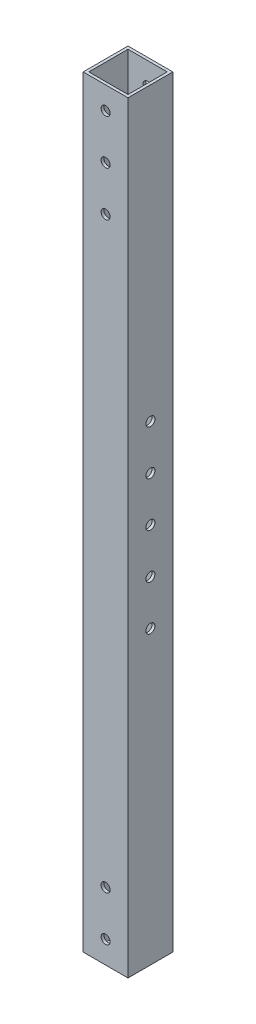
ISO-10303-21;
HEADER;
FILE_DESCRIPTION(('STEP AP214'),'2;1');
FILE_NAME('part.step','',(''),(''),'','','');
FILE_SCHEMA(('AUTOMOTIVE_DESIGN { 1 0 10303 214 1 1 1 1 }'));
ENDSEC;
DATA;
#1=APPLICATION_CONTEXT('core data for automotive mechanical design processes');
#2=APPLICATION_PROTOCOL_DEFINITION('international standard','automotive_design',2000,#1);
#3=PRODUCT_CONTEXT('',#1,'mechanical');
#4=PRODUCT('Part','Part','',(#3));
#5=PRODUCT_RELATED_PRODUCT_CATEGORY('part','',(#4));
#6=PRODUCT_DEFINITION_FORMATION('','',#4);
#7=PRODUCT_DEFINITION_CONTEXT('part definition',#1,'design');
#8=PRODUCT_DEFINITION('design','',#6,#7);
#9=PRODUCT_DEFINITION_SHAPE('','',#8);
#10=(LENGTH_UNIT() NAMED_UNIT(*) SI_UNIT(.MILLI.,.METRE.));
#11=(NAMED_UNIT(*) PLANE_ANGLE_UNIT() SI_UNIT($,.RADIAN.));
#12=(NAMED_UNIT(*) SI_UNIT($,.STERADIAN.) SOLID_ANGLE_UNIT());
#13=UNCERTAINTY_MEASURE_WITH_UNIT(LENGTH_MEASURE(1.E-05),#10,'distance_accuracy_value','');
#14=(GEOMETRIC_REPRESENTATION_CONTEXT(3) GLOBAL_UNCERTAINTY_ASSIGNED_CONTEXT((#13)) GLOBAL_UNIT_ASSIGNED_CONTEXT((#10,
#11,#12)) REPRESENTATION_CONTEXT('',''));
#15=CARTESIAN_POINT('',(0.,0.,0.));
#16=DIRECTION('',(0.,0.,1.));
#17=DIRECTION('',(1.,0.,0.));
#18=AXIS2_PLACEMENT_3D('',#15,#16,#17);
#19=CARTESIAN_POINT('',(0.,431.8,0.));
#20=DIRECTION('',(0.,-1.,0.));
#21=DIRECTION('',(0.,0.,-1.));
#22=AXIS2_PLACEMENT_3D('',#19,#20,#21);
#23=PLANE('',#22);
#24=DIRECTION('',(0.,0.,-1.));
#25=VECTOR('',#24,1.);
#26=CARTESIAN_POINT('',(12.7,431.8,12.7));
#27=LINE('',#26,#25);
#28=CARTESIAN_POINT('',(12.7,431.8,12.7));
#29=VERTEX_POINT('',#28);
#30=CARTESIAN_POINT('',(12.7,431.8,-12.7));
#31=VERTEX_POINT('',#30);
#32=EDGE_CURVE('E137',#29,#31,#27,.T.);
#33=ORIENTED_EDGE('',*,*,#32,.T.);
#34=DIRECTION('',(-1.,0.,0.));
#35=VECTOR('',#34,1.);
#36=CARTESIAN_POINT('',(-12.7,431.8,-12.7));
#37=LINE('',#36,#35);
#38=CARTESIAN_POINT('',(-12.7,431.8,-12.7));
#39=VERTEX_POINT('',#38);
#40=EDGE_CURVE('E140',#31,#39,#37,.T.);
#41=ORIENTED_EDGE('',*,*,#40,.T.);
#42=DIRECTION('',(0.,0.,1.));
#43=VECTOR('',#42,1.);
#44=CARTESIAN_POINT('',(-12.7,431.8,12.7));
#45=LINE('',#44,#43);
#46=CARTESIAN_POINT('',(-12.7,431.8,12.7));
#47=VERTEX_POINT('',#46);
#48=EDGE_CURVE('E143',#39,#47,#45,.T.);
#49=ORIENTED_EDGE('',*,*,#48,.T.);
#50=DIRECTION('',(1.,0.,0.));
#51=VECTOR('',#50,1.);
#52=CARTESIAN_POINT('',(-12.7,431.8,12.7));
#53=LINE('',#52,#51);
#54=EDGE_CURVE('E145',#47,#29,#53,.T.);
#55=ORIENTED_EDGE('',*,*,#54,.T.);
#56=EDGE_LOOP('',(#33,#41,#49,#55));
#57=FACE_BOUND('',#56,.T.);
#58=DIRECTION('',(0.,0.,-1.));
#59=VECTOR('',#58,1.);
#60=CARTESIAN_POINT('',(11.1125,431.8,11.1125));
#61=LINE('',#60,#59);
#62=CARTESIAN_POINT('',(11.1125,431.8,11.1125));
#63=VERTEX_POINT('',#62);
#64=CARTESIAN_POINT('',(11.1125,431.8,-11.1125));
#65=VERTEX_POINT('',#64);
#66=EDGE_CURVE('E99',#63,#65,#61,.T.);
#67=ORIENTED_EDGE('',*,*,#66,.F.);
#68=DIRECTION('',(1.,0.,0.));
#69=VECTOR('',#68,1.);
#70=CARTESIAN_POINT('',(-11.1125,431.8,11.1125));
#71=LINE('',#70,#69);
#72=CARTESIAN_POINT('',(-11.1125,431.8,11.1125));
#73=VERTEX_POINT('',#72);
#74=EDGE_CURVE('E121',#73,#63,#71,.T.);
#75=ORIENTED_EDGE('',*,*,#74,.F.);
#76=DIRECTION('',(0.,0.,1.));
#77=VECTOR('',#76,1.);
#78=CARTESIAN_POINT('',(-11.1125,431.8,11.1125));
#79=LINE('',#78,#77);
#80=CARTESIAN_POINT('',(-11.1125,431.8,-11.1125));
#81=VERTEX_POINT('',#80);
#82=EDGE_CURVE('E119',#81,#73,#79,.T.);
#83=ORIENTED_EDGE('',*,*,#82,.F.);
#84=DIRECTION('',(-1.,0.,0.));
#85=VECTOR('',#84,1.);
#86=CARTESIAN_POINT('',(-11.1125,431.8,-11.1125));
#87=LINE('',#86,#85);
#88=EDGE_CURVE('E107',#65,#81,#87,.T.);
#89=ORIENTED_EDGE('',*,*,#88,.F.);
#90=EDGE_LOOP('',(#67,#75,#83,#89));
#91=FACE_BOUND('',#90,.T.);
#92=ADVANCED_FACE('F32',(#57,#91),#23,.F.);
#93=CARTESIAN_POINT('',(0.,0.,0.));
#94=DIRECTION('',(0.,-1.,0.));
#95=DIRECTION('',(0.,0.,-1.));
#96=AXIS2_PLACEMENT_3D('',#93,#94,#95);
#97=PLANE('',#96);
#98=DIRECTION('',(0.,0.,-1.));
#99=VECTOR('',#98,1.);
#100=CARTESIAN_POINT('',(12.7,0.,12.7));
#101=LINE('',#100,#99);
#102=CARTESIAN_POINT('',(12.7,0.,12.7));
#103=VERTEX_POINT('',#102);
#104=CARTESIAN_POINT('',(12.7,0.,-12.7));
#105=VERTEX_POINT('',#104);
#106=EDGE_CURVE('E115',#103,#105,#101,.T.);
#107=ORIENTED_EDGE('',*,*,#106,.F.);
#108=DIRECTION('',(1.,0.,0.));
#109=VECTOR('',#108,1.);
#110=CARTESIAN_POINT('',(-12.7,0.,12.7));
#111=LINE('',#110,#109);
#112=CARTESIAN_POINT('',(-12.7,0.,12.7));
#113=VERTEX_POINT('',#112);
#114=EDGE_CURVE('E141',#113,#103,#111,.T.);
#115=ORIENTED_EDGE('',*,*,#114,.F.);
#116=DIRECTION('',(0.,0.,1.));
#117=VECTOR('',#116,1.);
#118=CARTESIAN_POINT('',(-12.7,0.,12.7));
#119=LINE('',#118,#117);
#120=CARTESIAN_POINT('',(-12.7,0.,-12.7));
#121=VERTEX_POINT('',#120);
#122=EDGE_CURVE('E152',#121,#113,#119,.T.);
#123=ORIENTED_EDGE('',*,*,#122,.F.);
#124=DIRECTION('',(-1.,0.,0.));
#125=VECTOR('',#124,1.);
#126=CARTESIAN_POINT('',(-12.7,0.,-12.7));
#127=LINE('',#126,#125);
#128=EDGE_CURVE('E150',#105,#121,#127,.T.);
#129=ORIENTED_EDGE('',*,*,#128,.F.);
#130=EDGE_LOOP('',(#107,#115,#123,#129));
#131=FACE_BOUND('',#130,.T.);
#132=DIRECTION('',(1.,0.,0.));
#133=VECTOR('',#132,1.);
#134=CARTESIAN_POINT('',(-11.1125,0.,11.1125));
#135=LINE('',#134,#133);
#136=CARTESIAN_POINT('',(-11.1125,0.,11.1125));
#137=VERTEX_POINT('',#136);
#138=CARTESIAN_POINT('',(11.1125,0.,11.1125));
#139=VERTEX_POINT('',#138);
#140=EDGE_CURVE('E108',#137,#139,#135,.T.);
#141=ORIENTED_EDGE('',*,*,#140,.T.);
#142=DIRECTION('',(0.,0.,-1.));
#143=VECTOR('',#142,1.);
#144=CARTESIAN_POINT('',(11.1125,0.,11.1125));
#145=LINE('',#144,#143);
#146=CARTESIAN_POINT('',(11.1125,0.,-11.1125));
#147=VERTEX_POINT('',#146);
#148=EDGE_CURVE('E57',#139,#147,#145,.T.);
#149=ORIENTED_EDGE('',*,*,#148,.T.);
#150=DIRECTION('',(-1.,0.,0.));
#151=VECTOR('',#150,1.);
#152=CARTESIAN_POINT('',(-11.1125,0.,-11.1125));
#153=LINE('',#152,#151);
#154=CARTESIAN_POINT('',(-11.1125,0.,-11.1125));
#155=VERTEX_POINT('',#154);
#156=EDGE_CURVE('E114',#147,#155,#153,.T.);
#157=ORIENTED_EDGE('',*,*,#156,.T.);
#158=DIRECTION('',(0.,0.,1.));
#159=VECTOR('',#158,1.);
#160=CARTESIAN_POINT('',(-11.1125,0.,11.1125));
#161=LINE('',#160,#159);
#162=EDGE_CURVE('E129',#155,#137,#161,.T.);
#163=ORIENTED_EDGE('',*,*,#162,.T.);
#164=EDGE_LOOP('',(#141,#149,#157,#163));
#165=FACE_BOUND('',#164,.T.);
#166=ADVANCED_FACE('F294',(#131,#165),#97,.T.);
#167=CARTESIAN_POINT('',(12.7,431.8,12.7));
#168=DIRECTION('',(-1.,0.,0.));
#169=DIRECTION('',(0.,0.,1.));
#170=AXIS2_PLACEMENT_3D('',#167,#168,#169);
#171=PLANE('',#170);
#172=CARTESIAN_POINT('',(12.7,165.1,5.22769947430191E-13));
#173=DIRECTION('',(1.,0.,0.));
#174=DIRECTION('',(0.,0.,-1.));
#175=AXIS2_PLACEMENT_3D('',#172,#173,#174);
#176=CIRCLE('',#175,2.55269999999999);
#177=CARTESIAN_POINT('',(12.7,165.1,-2.55269999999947));
#178=VERTEX_POINT('',#177);
#179=EDGE_CURVE('E408',#178,#178,#176,.T.);
#180=ORIENTED_EDGE('',*,*,#179,.F.);
#181=EDGE_LOOP('',(#180));
#182=FACE_BOUND('',#181,.T.);
#183=CARTESIAN_POINT('',(12.7,190.5,6.09898272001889E-13));
#184=DIRECTION('',(1.,0.,0.));
#185=DIRECTION('',(0.,0.,-1.));
#186=AXIS2_PLACEMENT_3D('',#183,#184,#185);
#187=CIRCLE('',#186,2.55269999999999);
#188=CARTESIAN_POINT('',(12.7,190.5,-2.55269999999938));
#189=VERTEX_POINT('',#188);
#190=EDGE_CURVE('E186',#189,#189,#187,.T.);
#191=ORIENTED_EDGE('',*,*,#190,.F.);
#192=EDGE_LOOP('',(#191));
#193=FACE_BOUND('',#192,.T.);
#194=CARTESIAN_POINT('',(12.7,215.9,6.97026596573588E-13));
#195=DIRECTION('',(1.,0.,0.));
#196=DIRECTION('',(0.,0.,-1.));
#197=AXIS2_PLACEMENT_3D('',#194,#195,#196);
#198=CIRCLE('',#197,2.55269999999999);
#199=CARTESIAN_POINT('',(12.7,215.9,-2.55269999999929));
#200=VERTEX_POINT('',#199);
#201=EDGE_CURVE('E183',#200,#200,#198,.T.);
#202=ORIENTED_EDGE('',*,*,#201,.F.);
#203=EDGE_LOOP('',(#202));
#204=FACE_BOUND('',#203,.T.);
#205=CARTESIAN_POINT('',(12.7,241.3,7.84154921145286E-13));
#206=DIRECTION('',(1.,0.,0.));
#207=DIRECTION('',(0.,0.,-1.));
#208=AXIS2_PLACEMENT_3D('',#205,#206,#207);
#209=CIRCLE('',#208,2.55269999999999);
#210=CARTESIAN_POINT('',(12.7,241.3,-2.55269999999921));
#211=VERTEX_POINT('',#210);
#212=EDGE_CURVE('E201',#211,#211,#209,.T.);
#213=ORIENTED_EDGE('',*,*,#212,.F.);
#214=EDGE_LOOP('',(#213));
#215=FACE_BOUND('',#214,.T.);
#216=CARTESIAN_POINT('',(12.7,266.7,8.71283245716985E-13));
#217=DIRECTION('',(1.,0.,0.));
#218=DIRECTION('',(0.,0.,-1.));
#219=AXIS2_PLACEMENT_3D('',#216,#217,#218);
#220=CIRCLE('',#219,2.55269999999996);
#221=CARTESIAN_POINT('',(12.7,266.7,-2.55269999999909));
#222=VERTEX_POINT('',#221);
#223=EDGE_CURVE('E213',#222,#222,#220,.T.);
#224=ORIENTED_EDGE('',*,*,#223,.F.);
#225=EDGE_LOOP('',(#224));
#226=FACE_BOUND('',#225,.T.);
#227=ORIENTED_EDGE('',*,*,#106,.T.);
#228=DIRECTION('',(0.,-1.,0.));
#229=VECTOR('',#228,1.);
#230=CARTESIAN_POINT('',(12.7,431.8,-12.7));
#231=LINE('',#230,#229);
#232=EDGE_CURVE('E11',#31,#105,#231,.T.);
#233=ORIENTED_EDGE('',*,*,#232,.F.);
#234=ORIENTED_EDGE('',*,*,#32,.F.);
#235=DIRECTION('',(0.,-1.,0.));
#236=VECTOR('',#235,1.);
#237=CARTESIAN_POINT('',(12.7,431.8,12.7));
#238=LINE('',#237,#236);
#239=EDGE_CURVE('E147',#29,#103,#238,.T.);
#240=ORIENTED_EDGE('',*,*,#239,.T.);
#241=EDGE_LOOP('',(#227,#233,#234,#240));
#242=FACE_BOUND('',#241,.T.);
#243=ADVANCED_FACE('F34',(#182,#193,#204,#215,#226,#242),#171,.F.);
#244=CARTESIAN_POINT('',(-12.7,431.8,-12.7));
#245=DIRECTION('',(0.,0.,1.));
#246=DIRECTION('',(1.,0.,0.));
#247=AXIS2_PLACEMENT_3D('',#244,#245,#246);
#248=PLANE('',#247);
#249=CARTESIAN_POINT('',(0.,12.7,-12.7));
#250=DIRECTION('',(0.,0.,1.));
#251=DIRECTION('',(1.,0.,0.));
#252=AXIS2_PLACEMENT_3D('',#249,#250,#251);
#253=CIRCLE('',#252,2.5527);
#254=CARTESIAN_POINT('',(2.5527,12.7,-12.7));
#255=VERTEX_POINT('',#254);
#256=EDGE_CURVE('E228',#255,#255,#253,.T.);
#257=ORIENTED_EDGE('',*,*,#256,.T.);
#258=EDGE_LOOP('',(#257));
#259=FACE_BOUND('',#258,.T.);
#260=CARTESIAN_POINT('',(0.,38.1,-12.7));
#261=DIRECTION('',(0.,0.,1.));
#262=DIRECTION('',(1.,0.,0.));
#263=AXIS2_PLACEMENT_3D('',#260,#261,#262);
#264=CIRCLE('',#263,2.5527);
#265=CARTESIAN_POINT('',(2.55269999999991,38.1,-12.7));
#266=VERTEX_POINT('',#265);
#267=EDGE_CURVE('E240',#266,#266,#264,.T.);
#268=ORIENTED_EDGE('',*,*,#267,.T.);
#269=EDGE_LOOP('',(#268));
#270=FACE_BOUND('',#269,.T.);
#271=CARTESIAN_POINT('',(-1.21979654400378E-12,368.3,-12.7));
#272=DIRECTION('',(0.,0.,1.));
#273=DIRECTION('',(1.,0.,0.));
#274=AXIS2_PLACEMENT_3D('',#271,#272,#273);
#275=CIRCLE('',#274,2.5527);
#276=CARTESIAN_POINT('',(2.55269999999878,368.3,-12.7));
#277=VERTEX_POINT('',#276);
#278=EDGE_CURVE('E171',#277,#277,#275,.T.);
#279=ORIENTED_EDGE('',*,*,#278,.T.);
#280=EDGE_LOOP('',(#279));
#281=FACE_BOUND('',#280,.T.);
#282=CARTESIAN_POINT('',(-1.30692486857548E-12,393.7,-12.7));
#283=DIRECTION('',(0.,0.,1.));
#284=DIRECTION('',(1.,0.,0.));
#285=AXIS2_PLACEMENT_3D('',#282,#283,#284);
#286=CIRCLE('',#285,2.5527);
#287=CARTESIAN_POINT('',(2.55269999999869,393.7,-12.7));
#288=VERTEX_POINT('',#287);
#289=EDGE_CURVE('E166',#288,#288,#286,.T.);
#290=ORIENTED_EDGE('',*,*,#289,.T.);
#291=EDGE_LOOP('',(#290));
#292=FACE_BOUND('',#291,.T.);
#293=CARTESIAN_POINT('',(-1.39405319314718E-12,419.1,-12.7));
#294=DIRECTION('',(0.,0.,1.));
#295=DIRECTION('',(1.,0.,0.));
#296=AXIS2_PLACEMENT_3D('',#293,#294,#295);
#297=CIRCLE('',#296,2.5527);
#298=CARTESIAN_POINT('',(2.5526999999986,419.1,-12.7));
#299=VERTEX_POINT('',#298);
#300=EDGE_CURVE('E266',#299,#299,#297,.T.);
#301=ORIENTED_EDGE('',*,*,#300,.T.);
#302=EDGE_LOOP('',(#301));
#303=FACE_BOUND('',#302,.T.);
#304=ORIENTED_EDGE('',*,*,#128,.T.);
#305=DIRECTION('',(0.,-1.,0.));
#306=VECTOR('',#305,1.);
#307=CARTESIAN_POINT('',(-12.7,431.8,-12.7));
#308=LINE('',#307,#306);
#309=EDGE_CURVE('E41',#39,#121,#308,.T.);
#310=ORIENTED_EDGE('',*,*,#309,.F.);
#311=ORIENTED_EDGE('',*,*,#40,.F.);
#312=ORIENTED_EDGE('',*,*,#232,.T.);
#313=EDGE_LOOP('',(#304,#310,#311,#312));
#314=FACE_BOUND('',#313,.T.);
#315=ADVANCED_FACE('F308',(#259,#270,#281,#292,#303,#314),#248,.F.);
#316=CARTESIAN_POINT('',(-12.7,431.8,12.7));
#317=DIRECTION('',(1.,0.,0.));
#318=DIRECTION('',(0.,0.,-1.));
#319=AXIS2_PLACEMENT_3D('',#316,#317,#318);
#320=PLANE('',#319);
#321=CARTESIAN_POINT('',(-12.7,165.1,5.22769947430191E-13));
#322=DIRECTION('',(1.,0.,0.));
#323=DIRECTION('',(0.,0.,-1.));
#324=AXIS2_PLACEMENT_3D('',#321,#322,#323);
#325=CIRCLE('',#324,2.55269999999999);
#326=CARTESIAN_POINT('',(-12.7,165.1,-2.55269999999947));
#327=VERTEX_POINT('',#326);
#328=EDGE_CURVE('E407',#327,#327,#325,.T.);
#329=ORIENTED_EDGE('',*,*,#328,.T.);
#330=EDGE_LOOP('',(#329));
#331=FACE_BOUND('',#330,.T.);
#332=CARTESIAN_POINT('',(-12.7,190.5,6.09898272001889E-13));
#333=DIRECTION('',(1.,0.,0.));
#334=DIRECTION('',(0.,0.,-1.));
#335=AXIS2_PLACEMENT_3D('',#332,#333,#334);
#336=CIRCLE('',#335,2.55269999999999);
#337=CARTESIAN_POINT('',(-12.7,190.5,-2.55269999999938));
#338=VERTEX_POINT('',#337);
#339=EDGE_CURVE('E179',#338,#338,#336,.T.);
#340=ORIENTED_EDGE('',*,*,#339,.T.);
#341=EDGE_LOOP('',(#340));
#342=FACE_BOUND('',#341,.T.);
#343=CARTESIAN_POINT('',(-12.7,215.9,6.97026596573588E-13));
#344=DIRECTION('',(1.,0.,0.));
#345=DIRECTION('',(0.,0.,-1.));
#346=AXIS2_PLACEMENT_3D('',#343,#344,#345);
#347=CIRCLE('',#346,2.55269999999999);
#348=CARTESIAN_POINT('',(-12.7,215.9,-2.55269999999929));
#349=VERTEX_POINT('',#348);
#350=EDGE_CURVE('E175',#349,#349,#347,.T.);
#351=ORIENTED_EDGE('',*,*,#350,.T.);
#352=EDGE_LOOP('',(#351));
#353=FACE_BOUND('',#352,.T.);
#354=CARTESIAN_POINT('',(-12.7,241.3,7.84154921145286E-13));
#355=DIRECTION('',(1.,0.,0.));
#356=DIRECTION('',(0.,0.,-1.));
#357=AXIS2_PLACEMENT_3D('',#354,#355,#356);
#358=CIRCLE('',#357,2.55269999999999);
#359=CARTESIAN_POINT('',(-12.7,241.3,-2.55269999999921));
#360=VERTEX_POINT('',#359);
#361=EDGE_CURVE('E204',#360,#360,#358,.T.);
#362=ORIENTED_EDGE('',*,*,#361,.T.);
#363=EDGE_LOOP('',(#362));
#364=FACE_BOUND('',#363,.T.);
#365=CARTESIAN_POINT('',(-12.7,266.7,8.71283245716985E-13));
#366=DIRECTION('',(1.,0.,0.));
#367=DIRECTION('',(0.,0.,-1.));
#368=AXIS2_PLACEMENT_3D('',#365,#366,#367);
#369=CIRCLE('',#368,2.55270000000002);
#370=CARTESIAN_POINT('',(-12.7,266.7,-2.55269999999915));
#371=VERTEX_POINT('',#370);
#372=EDGE_CURVE('E216',#371,#371,#369,.T.);
#373=ORIENTED_EDGE('',*,*,#372,.T.);
#374=EDGE_LOOP('',(#373));
#375=FACE_BOUND('',#374,.T.);
#376=ORIENTED_EDGE('',*,*,#122,.T.);
#377=DIRECTION('',(0.,-1.,0.));
#378=VECTOR('',#377,1.);
#379=CARTESIAN_POINT('',(-12.7,431.8,12.7));
#380=LINE('',#379,#378);
#381=EDGE_CURVE('E157',#47,#113,#380,.T.);
#382=ORIENTED_EDGE('',*,*,#381,.F.);
#383=ORIENTED_EDGE('',*,*,#48,.F.);
#384=ORIENTED_EDGE('',*,*,#309,.T.);
#385=EDGE_LOOP('',(#376,#382,#383,#384));
#386=FACE_BOUND('',#385,.T.);
#387=ADVANCED_FACE('F305',(#331,#342,#353,#364,#375,#386),#320,.F.);
#388=CARTESIAN_POINT('',(-12.7,431.8,12.7));
#389=DIRECTION('',(0.,0.,-1.));
#390=DIRECTION('',(-1.,0.,0.));
#391=AXIS2_PLACEMENT_3D('',#388,#389,#390);
#392=PLANE('',#391);
#393=CARTESIAN_POINT('',(0.,12.7,12.7));
#394=DIRECTION('',(0.,0.,1.));
#395=DIRECTION('',(1.,0.,0.));
#396=AXIS2_PLACEMENT_3D('',#393,#394,#395);
#397=CIRCLE('',#396,2.55269999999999);
#398=CARTESIAN_POINT('',(2.55269999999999,12.7,12.7));
#399=VERTEX_POINT('',#398);
#400=EDGE_CURVE('E225',#399,#399,#397,.T.);
#401=ORIENTED_EDGE('',*,*,#400,.F.);
#402=EDGE_LOOP('',(#401));
#403=FACE_BOUND('',#402,.T.);
#404=CARTESIAN_POINT('',(0.,38.1,12.7));
#405=DIRECTION('',(0.,0.,1.));
#406=DIRECTION('',(1.,0.,0.));
#407=AXIS2_PLACEMENT_3D('',#404,#405,#406);
#408=CIRCLE('',#407,2.55269999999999);
#409=CARTESIAN_POINT('',(2.5526999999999,38.1,12.7));
#410=VERTEX_POINT('',#409);
#411=EDGE_CURVE('E237',#410,#410,#408,.T.);
#412=ORIENTED_EDGE('',*,*,#411,.F.);
#413=EDGE_LOOP('',(#412));
#414=FACE_BOUND('',#413,.T.);
#415=CARTESIAN_POINT('',(-1.21979654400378E-12,368.3,12.7));
#416=DIRECTION('',(0.,0.,1.));
#417=DIRECTION('',(1.,0.,0.));
#418=AXIS2_PLACEMENT_3D('',#415,#416,#417);
#419=CIRCLE('',#418,2.55269999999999);
#420=CARTESIAN_POINT('',(2.55269999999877,368.3,12.7));
#421=VERTEX_POINT('',#420);
#422=EDGE_CURVE('E249',#421,#421,#419,.T.);
#423=ORIENTED_EDGE('',*,*,#422,.F.);
#424=EDGE_LOOP('',(#423));
#425=FACE_BOUND('',#424,.T.);
#426=CARTESIAN_POINT('',(-1.30692486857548E-12,393.7,12.7));
#427=DIRECTION('',(0.,0.,1.));
#428=DIRECTION('',(1.,0.,0.));
#429=AXIS2_PLACEMENT_3D('',#426,#427,#428);
#430=CIRCLE('',#429,2.55269999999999);
#431=CARTESIAN_POINT('',(2.55269999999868,393.7,12.7));
#432=VERTEX_POINT('',#431);
#433=EDGE_CURVE('E256',#432,#432,#430,.T.);
#434=ORIENTED_EDGE('',*,*,#433,.F.);
#435=EDGE_LOOP('',(#434));
#436=FACE_BOUND('',#435,.T.);
#437=CARTESIAN_POINT('',(-1.39405319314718E-12,419.1,12.7));
#438=DIRECTION('',(0.,0.,1.));
#439=DIRECTION('',(1.,0.,0.));
#440=AXIS2_PLACEMENT_3D('',#437,#438,#439);
#441=CIRCLE('',#440,2.55269999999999);
#442=CARTESIAN_POINT('',(2.55269999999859,419.1,12.7));
#443=VERTEX_POINT('',#442);
#444=EDGE_CURVE('E263',#443,#443,#441,.T.);
#445=ORIENTED_EDGE('',*,*,#444,.F.);
#446=EDGE_LOOP('',(#445));
#447=FACE_BOUND('',#446,.T.);
#448=ORIENTED_EDGE('',*,*,#114,.T.);
#449=ORIENTED_EDGE('',*,*,#239,.F.);
#450=ORIENTED_EDGE('',*,*,#54,.F.);
#451=ORIENTED_EDGE('',*,*,#381,.T.);
#452=EDGE_LOOP('',(#448,#449,#450,#451));
#453=FACE_BOUND('',#452,.T.);
#454=ADVANCED_FACE('F288',(#403,#414,#425,#436,#447,#453),#392,.F.);
#455=CARTESIAN_POINT('',(11.1125,431.8,11.1125));
#456=DIRECTION('',(-1.,0.,0.));
#457=DIRECTION('',(0.,0.,1.));
#458=AXIS2_PLACEMENT_3D('',#455,#456,#457);
#459=PLANE('',#458);
#460=CARTESIAN_POINT('',(11.1125,165.1,5.22769947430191E-13));
#461=DIRECTION('',(-1.,0.,0.));
#462=DIRECTION('',(0.,0.,1.));
#463=AXIS2_PLACEMENT_3D('',#460,#461,#462);
#464=CIRCLE('',#463,2.55269999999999);
#465=CARTESIAN_POINT('',(11.1125,165.1,2.55270000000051));
#466=VERTEX_POINT('',#465);
#467=EDGE_CURVE('E191',#466,#466,#464,.T.);
#468=ORIENTED_EDGE('',*,*,#467,.F.);
#469=EDGE_LOOP('',(#468));
#470=FACE_BOUND('',#469,.T.);
#471=CARTESIAN_POINT('',(11.1125,190.5,6.09898272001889E-13));
#472=DIRECTION('',(-1.,0.,0.));
#473=DIRECTION('',(0.,0.,1.));
#474=AXIS2_PLACEMENT_3D('',#471,#472,#473);
#475=CIRCLE('',#474,2.55269999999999);
#476=CARTESIAN_POINT('',(11.1125,190.5,2.5527000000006));
#477=VERTEX_POINT('',#476);
#478=EDGE_CURVE('E178',#477,#477,#475,.T.);
#479=ORIENTED_EDGE('',*,*,#478,.F.);
#480=EDGE_LOOP('',(#479));
#481=FACE_BOUND('',#480,.T.);
#482=CARTESIAN_POINT('',(11.1125,215.9,6.97026596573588E-13));
#483=DIRECTION('',(-1.,0.,0.));
#484=DIRECTION('',(0.,0.,1.));
#485=AXIS2_PLACEMENT_3D('',#482,#483,#484);
#486=CIRCLE('',#485,2.55269999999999);
#487=CARTESIAN_POINT('',(11.1125,215.9,2.55270000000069));
#488=VERTEX_POINT('',#487);
#489=EDGE_CURVE('E174',#488,#488,#486,.T.);
#490=ORIENTED_EDGE('',*,*,#489,.F.);
#491=EDGE_LOOP('',(#490));
#492=FACE_BOUND('',#491,.T.);
#493=CARTESIAN_POINT('',(11.1125,241.3,7.84154921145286E-13));
#494=DIRECTION('',(-1.,0.,0.));
#495=DIRECTION('',(0.,0.,1.));
#496=AXIS2_PLACEMENT_3D('',#493,#494,#495);
#497=CIRCLE('',#496,2.55269999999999);
#498=CARTESIAN_POINT('',(11.1125,241.3,2.55270000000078));
#499=VERTEX_POINT('',#498);
#500=EDGE_CURVE('E210',#499,#499,#497,.T.);
#501=ORIENTED_EDGE('',*,*,#500,.F.);
#502=EDGE_LOOP('',(#501));
#503=FACE_BOUND('',#502,.T.);
#504=CARTESIAN_POINT('',(11.1125,266.7,8.71283245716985E-13));
#505=DIRECTION('',(-1.,0.,0.));
#506=DIRECTION('',(0.,0.,1.));
#507=AXIS2_PLACEMENT_3D('',#504,#505,#506);
#508=CIRCLE('',#507,2.55269999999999);
#509=CARTESIAN_POINT('',(11.1125,266.7,2.55270000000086));
#510=VERTEX_POINT('',#509);
#511=EDGE_CURVE('E222',#510,#510,#508,.T.);
#512=ORIENTED_EDGE('',*,*,#511,.F.);
#513=EDGE_LOOP('',(#512));
#514=FACE_BOUND('',#513,.T.);
#515=ORIENTED_EDGE('',*,*,#148,.F.);
#516=DIRECTION('',(0.,-1.,0.));
#517=VECTOR('',#516,1.);
#518=CARTESIAN_POINT('',(11.1125,431.8,11.1125));
#519=LINE('',#518,#517);
#520=EDGE_CURVE('E103',#63,#139,#519,.T.);
#521=ORIENTED_EDGE('',*,*,#520,.F.);
#522=ORIENTED_EDGE('',*,*,#66,.T.);
#523=DIRECTION('',(0.,-1.,0.));
#524=VECTOR('',#523,1.);
#525=CARTESIAN_POINT('',(11.1125,431.8,-11.1125));
#526=LINE('',#525,#524);
#527=EDGE_CURVE('E102',#65,#147,#526,.T.);
#528=ORIENTED_EDGE('',*,*,#527,.T.);
#529=EDGE_LOOP('',(#515,#521,#522,#528));
#530=FACE_BOUND('',#529,.T.);
#531=ADVANCED_FACE('F101',(#470,#481,#492,#503,#514,#530),#459,.T.);
#532=CARTESIAN_POINT('',(-11.1125,431.8,-11.1125));
#533=DIRECTION('',(0.,0.,1.));
#534=DIRECTION('',(1.,0.,0.));
#535=AXIS2_PLACEMENT_3D('',#532,#533,#534);
#536=PLANE('',#535);
#537=CARTESIAN_POINT('',(0.,12.7,-11.1125));
#538=DIRECTION('',(0.,0.,1.));
#539=DIRECTION('',(1.,0.,0.));
#540=AXIS2_PLACEMENT_3D('',#537,#538,#539);
#541=CIRCLE('',#540,2.55269999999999);
#542=CARTESIAN_POINT('',(2.55269999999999,12.7,-11.1125));
#543=VERTEX_POINT('',#542);
#544=EDGE_CURVE('E231',#543,#543,#541,.T.);
#545=ORIENTED_EDGE('',*,*,#544,.F.);
#546=EDGE_LOOP('',(#545));
#547=FACE_BOUND('',#546,.T.);
#548=CARTESIAN_POINT('',(0.,38.1,-11.1125));
#549=DIRECTION('',(0.,0.,1.));
#550=DIRECTION('',(1.,0.,0.));
#551=AXIS2_PLACEMENT_3D('',#548,#549,#550);
#552=CIRCLE('',#551,2.55269999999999);
#553=CARTESIAN_POINT('',(2.5526999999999,38.1,-11.1125));
#554=VERTEX_POINT('',#553);
#555=EDGE_CURVE('E246',#554,#554,#552,.T.);
#556=ORIENTED_EDGE('',*,*,#555,.F.);
#557=EDGE_LOOP('',(#556));
#558=FACE_BOUND('',#557,.T.);
#559=CARTESIAN_POINT('',(-1.21979654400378E-12,368.3,-11.1125));
#560=DIRECTION('',(0.,0.,1.));
#561=DIRECTION('',(1.,0.,0.));
#562=AXIS2_PLACEMENT_3D('',#559,#560,#561);
#563=CIRCLE('',#562,2.55269999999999);
#564=CARTESIAN_POINT('',(2.55269999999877,368.3,-11.1125));
#565=VERTEX_POINT('',#564);
#566=EDGE_CURVE('E170',#565,#565,#563,.T.);
#567=ORIENTED_EDGE('',*,*,#566,.F.);
#568=EDGE_LOOP('',(#567));
#569=FACE_BOUND('',#568,.T.);
#570=CARTESIAN_POINT('',(-1.30692486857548E-12,393.7,-11.1125));
#571=DIRECTION('',(0.,0.,1.));
#572=DIRECTION('',(1.,0.,0.));
#573=AXIS2_PLACEMENT_3D('',#570,#571,#572);
#574=CIRCLE('',#573,2.55269999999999);
#575=CARTESIAN_POINT('',(2.55269999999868,393.7,-11.1125));
#576=VERTEX_POINT('',#575);
#577=EDGE_CURVE('E165',#576,#576,#574,.T.);
#578=ORIENTED_EDGE('',*,*,#577,.F.);
#579=EDGE_LOOP('',(#578));
#580=FACE_BOUND('',#579,.T.);
#581=CARTESIAN_POINT('',(-1.39405319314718E-12,419.1,-11.1125));
#582=DIRECTION('',(0.,0.,1.));
#583=DIRECTION('',(1.,0.,0.));
#584=AXIS2_PLACEMENT_3D('',#581,#582,#583);
#585=CIRCLE('',#584,2.55269999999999);
#586=CARTESIAN_POINT('',(2.5526999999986,419.1,-11.1125));
#587=VERTEX_POINT('',#586);
#588=EDGE_CURVE('E127',#587,#587,#585,.T.);
#589=ORIENTED_EDGE('',*,*,#588,.F.);
#590=EDGE_LOOP('',(#589));
#591=FACE_BOUND('',#590,.T.);
#592=ORIENTED_EDGE('',*,*,#156,.F.);
#593=ORIENTED_EDGE('',*,*,#527,.F.);
#594=ORIENTED_EDGE('',*,*,#88,.T.);
#595=DIRECTION('',(0.,-1.,0.));
#596=VECTOR('',#595,1.);
#597=CARTESIAN_POINT('',(-11.1125,431.8,-11.1125));
#598=LINE('',#597,#596);
#599=EDGE_CURVE('E116',#81,#155,#598,.T.);
#600=ORIENTED_EDGE('',*,*,#599,.T.);
#601=EDGE_LOOP('',(#592,#593,#594,#600));
#602=FACE_BOUND('',#601,.T.);
#603=ADVANCED_FACE('F111',(#547,#558,#569,#580,#591,#602),#536,.T.);
#604=CARTESIAN_POINT('',(-11.1125,431.8,11.1125));
#605=DIRECTION('',(1.,0.,0.));
#606=DIRECTION('',(0.,0.,-1.));
#607=AXIS2_PLACEMENT_3D('',#604,#605,#606);
#608=PLANE('',#607);
#609=CARTESIAN_POINT('',(-11.1125,165.1,5.22769947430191E-13));
#610=DIRECTION('',(1.,0.,0.));
#611=DIRECTION('',(0.,0.,-1.));
#612=AXIS2_PLACEMENT_3D('',#609,#610,#611);
#613=CIRCLE('',#612,2.55269999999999);
#614=CARTESIAN_POINT('',(-11.1125,165.1,-2.55269999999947));
#615=VERTEX_POINT('',#614);
#616=EDGE_CURVE('E36',#615,#615,#613,.T.);
#617=ORIENTED_EDGE('',*,*,#616,.F.);
#618=EDGE_LOOP('',(#617));
#619=FACE_BOUND('',#618,.T.);
#620=CARTESIAN_POINT('',(-11.1125,190.5,6.09898272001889E-13));
#621=DIRECTION('',(1.,0.,0.));
#622=DIRECTION('',(0.,0.,-1.));
#623=AXIS2_PLACEMENT_3D('',#620,#621,#622);
#624=CIRCLE('',#623,2.55269999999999);
#625=CARTESIAN_POINT('',(-11.1125,190.5,-2.55269999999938));
#626=VERTEX_POINT('',#625);
#627=EDGE_CURVE('E176',#626,#626,#624,.T.);
#628=ORIENTED_EDGE('',*,*,#627,.F.);
#629=EDGE_LOOP('',(#628));
#630=FACE_BOUND('',#629,.T.);
#631=CARTESIAN_POINT('',(-11.1125,215.9,6.97026596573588E-13));
#632=DIRECTION('',(1.,0.,0.));
#633=DIRECTION('',(0.,0.,-1.));
#634=AXIS2_PLACEMENT_3D('',#631,#632,#633);
#635=CIRCLE('',#634,2.55269999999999);
#636=CARTESIAN_POINT('',(-11.1125,215.9,-2.55269999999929));
#637=VERTEX_POINT('',#636);
#638=EDGE_CURVE('E172',#637,#637,#635,.T.);
#639=ORIENTED_EDGE('',*,*,#638,.F.);
#640=EDGE_LOOP('',(#639));
#641=FACE_BOUND('',#640,.T.);
#642=CARTESIAN_POINT('',(-11.1125,241.3,7.84154921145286E-13));
#643=DIRECTION('',(1.,0.,0.));
#644=DIRECTION('',(0.,0.,-1.));
#645=AXIS2_PLACEMENT_3D('',#642,#643,#644);
#646=CIRCLE('',#645,2.55269999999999);
#647=CARTESIAN_POINT('',(-11.1125,241.3,-2.55269999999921));
#648=VERTEX_POINT('',#647);
#649=EDGE_CURVE('E207',#648,#648,#646,.T.);
#650=ORIENTED_EDGE('',*,*,#649,.F.);
#651=EDGE_LOOP('',(#650));
#652=FACE_BOUND('',#651,.T.);
#653=CARTESIAN_POINT('',(-11.1125,266.7,8.71283245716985E-13));
#654=DIRECTION('',(1.,0.,0.));
#655=DIRECTION('',(0.,0.,-1.));
#656=AXIS2_PLACEMENT_3D('',#653,#654,#655);
#657=CIRCLE('',#656,2.55269999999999);
#658=CARTESIAN_POINT('',(-11.1125,266.7,-2.55269999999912));
#659=VERTEX_POINT('',#658);
#660=EDGE_CURVE('E219',#659,#659,#657,.T.);
#661=ORIENTED_EDGE('',*,*,#660,.F.);
#662=EDGE_LOOP('',(#661));
#663=FACE_BOUND('',#662,.T.);
#664=ORIENTED_EDGE('',*,*,#162,.F.);
#665=ORIENTED_EDGE('',*,*,#599,.F.);
#666=ORIENTED_EDGE('',*,*,#82,.T.);
#667=DIRECTION('',(0.,-1.,0.));
#668=VECTOR('',#667,1.);
#669=CARTESIAN_POINT('',(-11.1125,431.8,11.1125));
#670=LINE('',#669,#668);
#671=EDGE_CURVE('E49',#73,#137,#670,.T.);
#672=ORIENTED_EDGE('',*,*,#671,.T.);
#673=EDGE_LOOP('',(#664,#665,#666,#672));
#674=FACE_BOUND('',#673,.T.);
#675=ADVANCED_FACE('F278',(#619,#630,#641,#652,#663,#674),#608,.T.);
#676=CARTESIAN_POINT('',(-11.1125,431.8,11.1125));
#677=DIRECTION('',(0.,0.,-1.));
#678=DIRECTION('',(-1.,0.,0.));
#679=AXIS2_PLACEMENT_3D('',#676,#677,#678);
#680=PLANE('',#679);
#681=CARTESIAN_POINT('',(0.,12.7,11.1125));
#682=DIRECTION('',(0.,0.,-1.));
#683=DIRECTION('',(-1.,0.,0.));
#684=AXIS2_PLACEMENT_3D('',#681,#682,#683);
#685=CIRCLE('',#684,2.55269999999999);
#686=CARTESIAN_POINT('',(-2.55269999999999,12.7,11.1125));
#687=VERTEX_POINT('',#686);
#688=EDGE_CURVE('E234',#687,#687,#685,.T.);
#689=ORIENTED_EDGE('',*,*,#688,.F.);
#690=EDGE_LOOP('',(#689));
#691=FACE_BOUND('',#690,.T.);
#692=CARTESIAN_POINT('',(0.,38.1,11.1125));
#693=DIRECTION('',(0.,0.,-1.));
#694=DIRECTION('',(-1.,0.,0.));
#695=AXIS2_PLACEMENT_3D('',#692,#693,#694);
#696=CIRCLE('',#695,2.55269999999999);
#697=CARTESIAN_POINT('',(-2.55270000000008,38.1,11.1125));
#698=VERTEX_POINT('',#697);
#699=EDGE_CURVE('E243',#698,#698,#696,.T.);
#700=ORIENTED_EDGE('',*,*,#699,.F.);
#701=EDGE_LOOP('',(#700));
#702=FACE_BOUND('',#701,.T.);
#703=CARTESIAN_POINT('',(-1.21979654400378E-12,368.3,11.1125));
#704=DIRECTION('',(0.,0.,-1.));
#705=DIRECTION('',(-1.,0.,0.));
#706=AXIS2_PLACEMENT_3D('',#703,#704,#705);
#707=CIRCLE('',#706,2.55269999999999);
#708=CARTESIAN_POINT('',(-2.55270000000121,368.3,11.1125));
#709=VERTEX_POINT('',#708);
#710=EDGE_CURVE('E167',#709,#709,#707,.T.);
#711=ORIENTED_EDGE('',*,*,#710,.F.);
#712=EDGE_LOOP('',(#711));
#713=FACE_BOUND('',#712,.T.);
#714=CARTESIAN_POINT('',(-1.30692486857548E-12,393.7,11.1125));
#715=DIRECTION('',(0.,0.,-1.));
#716=DIRECTION('',(-1.,0.,0.));
#717=AXIS2_PLACEMENT_3D('',#714,#715,#716);
#718=CIRCLE('',#717,2.55269999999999);
#719=CARTESIAN_POINT('',(-2.5527000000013,393.7,11.1125));
#720=VERTEX_POINT('',#719);
#721=EDGE_CURVE('E162',#720,#720,#718,.T.);
#722=ORIENTED_EDGE('',*,*,#721,.F.);
#723=EDGE_LOOP('',(#722));
#724=FACE_BOUND('',#723,.T.);
#725=CARTESIAN_POINT('',(-1.39405319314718E-12,419.1,11.1125));
#726=DIRECTION('',(0.,0.,-1.));
#727=DIRECTION('',(-1.,0.,0.));
#728=AXIS2_PLACEMENT_3D('',#725,#726,#727);
#729=CIRCLE('',#728,2.55269999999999);
#730=CARTESIAN_POINT('',(-2.55270000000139,419.1,11.1125));
#731=VERTEX_POINT('',#730);
#732=EDGE_CURVE('E269',#731,#731,#729,.T.);
#733=ORIENTED_EDGE('',*,*,#732,.F.);
#734=EDGE_LOOP('',(#733));
#735=FACE_BOUND('',#734,.T.);
#736=ORIENTED_EDGE('',*,*,#140,.F.);
#737=ORIENTED_EDGE('',*,*,#671,.F.);
#738=ORIENTED_EDGE('',*,*,#74,.T.);
#739=ORIENTED_EDGE('',*,*,#520,.T.);
#740=EDGE_LOOP('',(#736,#737,#738,#739));
#741=FACE_BOUND('',#740,.T.);
#742=ADVANCED_FACE('F285',(#691,#702,#713,#724,#735,#741),#680,.T.);
#743=CARTESIAN_POINT('',(-1.39405319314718E-12,419.1,12.7));
#744=DIRECTION('',(0.,0.,1.));
#745=DIRECTION('',(1.,0.,0.));
#746=AXIS2_PLACEMENT_3D('',#743,#744,#745);
#747=CYLINDRICAL_SURFACE('',#746,2.55269999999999);
#748=ORIENTED_EDGE('',*,*,#732,.T.);
#749=EDGE_LOOP('',(#748));
#750=FACE_BOUND('',#749,.T.);
#751=ORIENTED_EDGE('',*,*,#444,.T.);
#752=EDGE_LOOP('',(#751));
#753=FACE_BOUND('',#752,.T.);
#754=ADVANCED_FACE('F342',(#750,#753),#747,.F.);
#755=ORIENTED_EDGE('',*,*,#588,.T.);
#756=EDGE_LOOP('',(#755));
#757=FACE_BOUND('',#756,.T.);
#758=ORIENTED_EDGE('',*,*,#300,.F.);
#759=EDGE_LOOP('',(#758));
#760=FACE_BOUND('',#759,.T.);
#761=ADVANCED_FACE('F274',(#757,#760),#747,.F.);
#762=CARTESIAN_POINT('',(-1.30692486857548E-12,393.7,12.7));
#763=DIRECTION('',(0.,0.,1.));
#764=DIRECTION('',(1.,0.,0.));
#765=AXIS2_PLACEMENT_3D('',#762,#763,#764);
#766=CYLINDRICAL_SURFACE('',#765,2.55269999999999);
#767=ORIENTED_EDGE('',*,*,#721,.T.);
#768=EDGE_LOOP('',(#767));
#769=FACE_BOUND('',#768,.T.);
#770=ORIENTED_EDGE('',*,*,#433,.T.);
#771=EDGE_LOOP('',(#770));
#772=FACE_BOUND('',#771,.T.);
#773=ADVANCED_FACE('F353',(#769,#772),#766,.F.);
#774=ORIENTED_EDGE('',*,*,#577,.T.);
#775=EDGE_LOOP('',(#774));
#776=FACE_BOUND('',#775,.T.);
#777=ORIENTED_EDGE('',*,*,#289,.F.);
#778=EDGE_LOOP('',(#777));
#779=FACE_BOUND('',#778,.T.);
#780=ADVANCED_FACE('F356',(#776,#779),#766,.F.);
#781=CARTESIAN_POINT('',(-1.21979654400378E-12,368.3,12.7));
#782=DIRECTION('',(0.,0.,1.));
#783=DIRECTION('',(1.,0.,0.));
#784=AXIS2_PLACEMENT_3D('',#781,#782,#783);
#785=CYLINDRICAL_SURFACE('',#784,2.55269999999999);
#786=ORIENTED_EDGE('',*,*,#710,.T.);
#787=EDGE_LOOP('',(#786));
#788=FACE_BOUND('',#787,.T.);
#789=ORIENTED_EDGE('',*,*,#422,.T.);
#790=EDGE_LOOP('',(#789));
#791=FACE_BOUND('',#790,.T.);
#792=ADVANCED_FACE('F358',(#788,#791),#785,.F.);
#793=ORIENTED_EDGE('',*,*,#566,.T.);
#794=EDGE_LOOP('',(#793));
#795=FACE_BOUND('',#794,.T.);
#796=ORIENTED_EDGE('',*,*,#278,.F.);
#797=EDGE_LOOP('',(#796));
#798=FACE_BOUND('',#797,.T.);
#799=ADVANCED_FACE('F361',(#795,#798),#785,.F.);
#800=CARTESIAN_POINT('',(0.,38.1,12.7));
#801=DIRECTION('',(0.,0.,1.));
#802=DIRECTION('',(1.,0.,0.));
#803=AXIS2_PLACEMENT_3D('',#800,#801,#802);
#804=CYLINDRICAL_SURFACE('',#803,2.55269999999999);
#805=ORIENTED_EDGE('',*,*,#699,.T.);
#806=EDGE_LOOP('',(#805));
#807=FACE_BOUND('',#806,.T.);
#808=ORIENTED_EDGE('',*,*,#411,.T.);
#809=EDGE_LOOP('',(#808));
#810=FACE_BOUND('',#809,.T.);
#811=ADVANCED_FACE('F363',(#807,#810),#804,.F.);
#812=ORIENTED_EDGE('',*,*,#555,.T.);
#813=EDGE_LOOP('',(#812));
#814=FACE_BOUND('',#813,.T.);
#815=ORIENTED_EDGE('',*,*,#267,.F.);
#816=EDGE_LOOP('',(#815));
#817=FACE_BOUND('',#816,.T.);
#818=ADVANCED_FACE('F366',(#814,#817),#804,.F.);
#819=CARTESIAN_POINT('',(0.,12.7,12.7));
#820=DIRECTION('',(0.,0.,1.));
#821=DIRECTION('',(1.,0.,0.));
#822=AXIS2_PLACEMENT_3D('',#819,#820,#821);
#823=CYLINDRICAL_SURFACE('',#822,2.55269999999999);
#824=ORIENTED_EDGE('',*,*,#688,.T.);
#825=EDGE_LOOP('',(#824));
#826=FACE_BOUND('',#825,.T.);
#827=ORIENTED_EDGE('',*,*,#400,.T.);
#828=EDGE_LOOP('',(#827));
#829=FACE_BOUND('',#828,.T.);
#830=ADVANCED_FACE('F372',(#826,#829),#823,.F.);
#831=ORIENTED_EDGE('',*,*,#544,.T.);
#832=EDGE_LOOP('',(#831));
#833=FACE_BOUND('',#832,.T.);
#834=ORIENTED_EDGE('',*,*,#256,.F.);
#835=EDGE_LOOP('',(#834));
#836=FACE_BOUND('',#835,.T.);
#837=ADVANCED_FACE('F368',(#833,#836),#823,.F.);
#838=CARTESIAN_POINT('',(12.7,266.7,8.71283245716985E-13));
#839=DIRECTION('',(1.,0.,0.));
#840=DIRECTION('',(0.,0.,-1.));
#841=AXIS2_PLACEMENT_3D('',#838,#839,#840);
#842=CYLINDRICAL_SURFACE('',#841,2.55269999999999);
#843=ORIENTED_EDGE('',*,*,#660,.T.);
#844=EDGE_LOOP('',(#843));
#845=FACE_BOUND('',#844,.T.);
#846=ORIENTED_EDGE('',*,*,#372,.F.);
#847=EDGE_LOOP('',(#846));
#848=FACE_BOUND('',#847,.T.);
#849=ADVANCED_FACE('F371',(#845,#848),#842,.F.);
#850=ORIENTED_EDGE('',*,*,#511,.T.);
#851=EDGE_LOOP('',(#850));
#852=FACE_BOUND('',#851,.T.);
#853=ORIENTED_EDGE('',*,*,#223,.T.);
#854=EDGE_LOOP('',(#853));
#855=FACE_BOUND('',#854,.T.);
#856=ADVANCED_FACE('F376',(#852,#855),#842,.F.);
#857=CARTESIAN_POINT('',(12.7,241.3,7.84154921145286E-13));
#858=DIRECTION('',(1.,0.,0.));
#859=DIRECTION('',(0.,0.,-1.));
#860=AXIS2_PLACEMENT_3D('',#857,#858,#859);
#861=CYLINDRICAL_SURFACE('',#860,2.55269999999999);
#862=ORIENTED_EDGE('',*,*,#500,.T.);
#863=EDGE_LOOP('',(#862));
#864=FACE_BOUND('',#863,.T.);
#865=ORIENTED_EDGE('',*,*,#212,.T.);
#866=EDGE_LOOP('',(#865));
#867=FACE_BOUND('',#866,.T.);
#868=ADVANCED_FACE('F382',(#864,#867),#861,.F.);
#869=ORIENTED_EDGE('',*,*,#649,.T.);
#870=EDGE_LOOP('',(#869));
#871=FACE_BOUND('',#870,.T.);
#872=ORIENTED_EDGE('',*,*,#361,.F.);
#873=EDGE_LOOP('',(#872));
#874=FACE_BOUND('',#873,.T.);
#875=ADVANCED_FACE('F378',(#871,#874),#861,.F.);
#876=CARTESIAN_POINT('',(12.7,215.9,6.97026596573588E-13));
#877=DIRECTION('',(1.,0.,0.));
#878=DIRECTION('',(0.,0.,-1.));
#879=AXIS2_PLACEMENT_3D('',#876,#877,#878);
#880=CYLINDRICAL_SURFACE('',#879,2.55269999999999);
#881=ORIENTED_EDGE('',*,*,#638,.T.);
#882=EDGE_LOOP('',(#881));
#883=FACE_BOUND('',#882,.T.);
#884=ORIENTED_EDGE('',*,*,#350,.F.);
#885=EDGE_LOOP('',(#884));
#886=FACE_BOUND('',#885,.T.);
#887=ADVANCED_FACE('F381',(#883,#886),#880,.F.);
#888=ORIENTED_EDGE('',*,*,#489,.T.);
#889=EDGE_LOOP('',(#888));
#890=FACE_BOUND('',#889,.T.);
#891=ORIENTED_EDGE('',*,*,#201,.T.);
#892=EDGE_LOOP('',(#891));
#893=FACE_BOUND('',#892,.T.);
#894=ADVANCED_FACE('F386',(#890,#893),#880,.F.);
#895=CARTESIAN_POINT('',(12.7,190.5,6.09898272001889E-13));
#896=DIRECTION('',(1.,0.,0.));
#897=DIRECTION('',(0.,0.,-1.));
#898=AXIS2_PLACEMENT_3D('',#895,#896,#897);
#899=CYLINDRICAL_SURFACE('',#898,2.55269999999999);
#900=ORIENTED_EDGE('',*,*,#627,.T.);
#901=EDGE_LOOP('',(#900));
#902=FACE_BOUND('',#901,.T.);
#903=ORIENTED_EDGE('',*,*,#339,.F.);
#904=EDGE_LOOP('',(#903));
#905=FACE_BOUND('',#904,.T.);
#906=ADVANCED_FACE('F388',(#902,#905),#899,.F.);
#907=ORIENTED_EDGE('',*,*,#478,.T.);
#908=EDGE_LOOP('',(#907));
#909=FACE_BOUND('',#908,.T.);
#910=ORIENTED_EDGE('',*,*,#190,.T.);
#911=EDGE_LOOP('',(#910));
#912=FACE_BOUND('',#911,.T.);
#913=ADVANCED_FACE('F391',(#909,#912),#899,.F.);
#914=CARTESIAN_POINT('',(12.7,165.1,5.22769947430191E-13));
#915=DIRECTION('',(1.,0.,0.));
#916=DIRECTION('',(0.,0.,-1.));
#917=AXIS2_PLACEMENT_3D('',#914,#915,#916);
#918=CYLINDRICAL_SURFACE('',#917,2.55269999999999);
#919=ORIENTED_EDGE('',*,*,#616,.T.);
#920=EDGE_LOOP('',(#919));
#921=FACE_BOUND('',#920,.T.);
#922=ORIENTED_EDGE('',*,*,#328,.F.);
#923=EDGE_LOOP('',(#922));
#924=FACE_BOUND('',#923,.T.);
#925=ADVANCED_FACE('F392',(#921,#924),#918,.F.);
#926=ORIENTED_EDGE('',*,*,#467,.T.);
#927=EDGE_LOOP('',(#926));
#928=FACE_BOUND('',#927,.T.);
#929=ORIENTED_EDGE('',*,*,#179,.T.);
#930=EDGE_LOOP('',(#929));
#931=FACE_BOUND('',#930,.T.);
#932=ADVANCED_FACE('F394',(#928,#931),#918,.F.);
#933=CLOSED_SHELL('',(#92,#166,#243,#315,#387,#454,#531,#603,#675,#742,#754,#761,#773,#780,#792,
#799,#811,#818,#830,#837,#849,#856,#868,#875,#887,#894,#906,#913,#925,#932));
#934=MANIFOLD_SOLID_BREP('B2',#933);
#935=ADVANCED_BREP_SHAPE_REPRESENTATION('',(#18,#934),#14);
#936=SHAPE_DEFINITION_REPRESENTATION(#9,#935);
ENDSEC;
END-ISO-10303-21;
